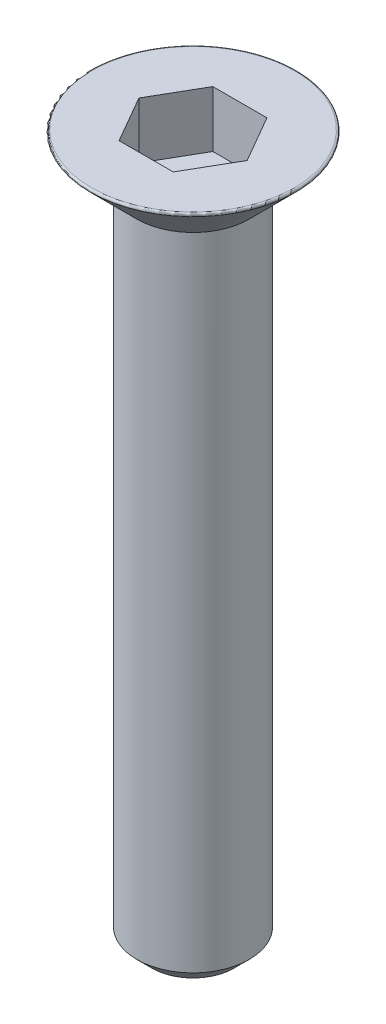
from build123d import *

# Parameters (mm, degrees)
CONG_1_R                = 0.1
CHANFREIN1_SIZE         = 0.8
ENL_V_MAT_EXTRU_1_DEPTH = 3


with BuildPart() as part:
    # Esquisse1 → R_volution1 (revolve)
    with BuildSketch(Plane.XY, mode=Mode.PRIVATE) as r_volution1_sk:
        Polygon((0, 0), (-5.65, 0), (-3, -2.65), (-3, -37.65), (0, -37.65), align=None)
    revolve(r_volution1_sk.sketch.rotate(Axis((0, 15.487971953, 0), (0, -1, 0)), 270), axis=Axis((0, 15.487971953, 0), (0, -1, 0)))

    # Cong_1
    cong_1_edges = [part.edges().sort_by_distance(p)[0] for p in [
        (0, 0, -5.65),
    ]]
    fillet(cong_1_edges, radius=CONG_1_R)

    # Chanfrein1
    chanfrein1_edges = [part.edges().sort_by_distance(p)[0] for p in [
        (0, -37.65, -3),
    ]]
    chamfer(chanfrein1_edges, length=CHANFREIN1_SIZE)

    # Esquisse2 → Enl_v. mat.-Extru.1 (cut)
    with BuildSketch(Plane(origin=(0, 0, 0), x_dir=(1, 0, 0), z_dir=(0, 1, 0))):
        Polygon((2.886751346, 0), (1.443375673, 2.5), (-1.443375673, 2.5), (-2.886751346, 0), (-1.443375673, -2.5), (1.443375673, -2.5), align=None)
    extrude(amount=-ENL_V_MAT_EXTRU_1_DEPTH, mode=Mode.SUBTRACT)


solid = part.part
